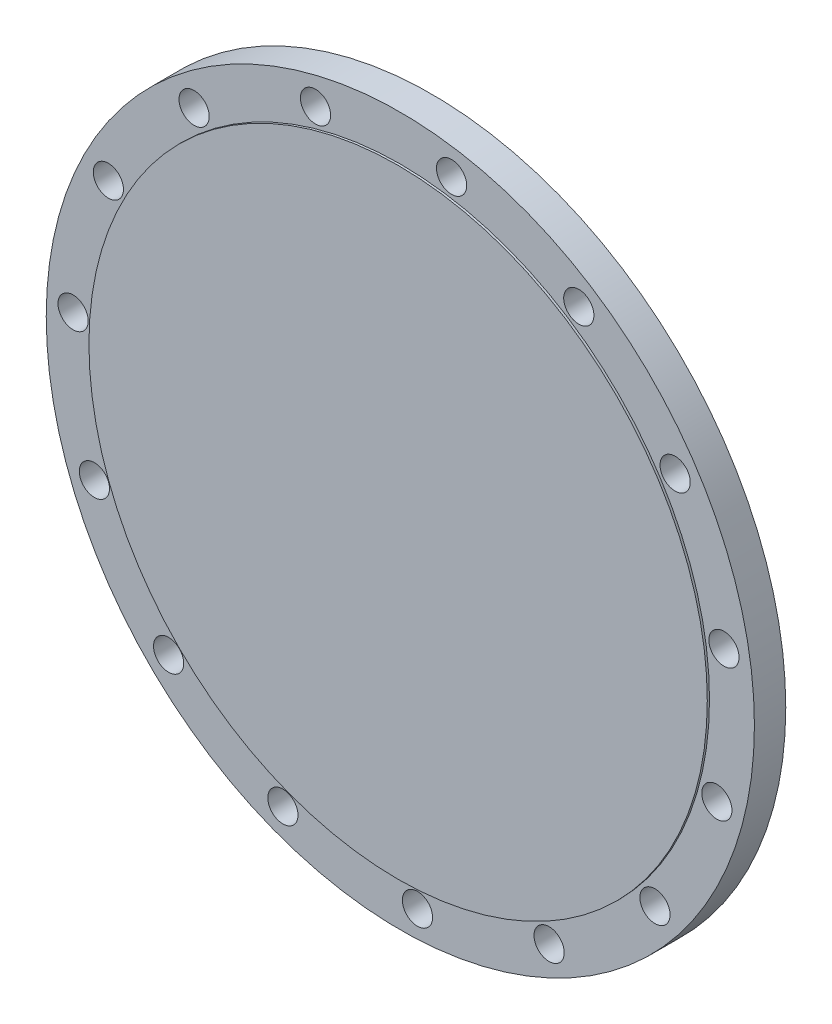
ISO-10303-21;
HEADER;
FILE_DESCRIPTION(('STEP AP214'),'2;1');
FILE_NAME('part.step','',(''),(''),'','','');
FILE_SCHEMA(('AUTOMOTIVE_DESIGN { 1 0 10303 214 1 1 1 1 }'));
ENDSEC;
DATA;
#1=APPLICATION_CONTEXT('core data for automotive mechanical design processes');
#2=APPLICATION_PROTOCOL_DEFINITION('international standard','automotive_design',2000,#1);
#3=PRODUCT_CONTEXT('',#1,'mechanical');
#4=PRODUCT('Part','Part','',(#3));
#5=PRODUCT_RELATED_PRODUCT_CATEGORY('part','',(#4));
#6=PRODUCT_DEFINITION_FORMATION('','',#4);
#7=PRODUCT_DEFINITION_CONTEXT('part definition',#1,'design');
#8=PRODUCT_DEFINITION('design','',#6,#7);
#9=PRODUCT_DEFINITION_SHAPE('','',#8);
#10=(LENGTH_UNIT() NAMED_UNIT(*) SI_UNIT(.MILLI.,.METRE.));
#11=(NAMED_UNIT(*) PLANE_ANGLE_UNIT() SI_UNIT($,.RADIAN.));
#12=(NAMED_UNIT(*) SI_UNIT($,.STERADIAN.) SOLID_ANGLE_UNIT());
#13=UNCERTAINTY_MEASURE_WITH_UNIT(LENGTH_MEASURE(1.E-05),#10,'distance_accuracy_value','');
#14=(GEOMETRIC_REPRESENTATION_CONTEXT(3) GLOBAL_UNCERTAINTY_ASSIGNED_CONTEXT((#13)) GLOBAL_UNIT_ASSIGNED_CONTEXT((#10,
#11,#12)) REPRESENTATION_CONTEXT('',''));
#15=CARTESIAN_POINT('',(0.,0.,0.));
#16=DIRECTION('',(0.,0.,1.));
#17=DIRECTION('',(1.,0.,0.));
#18=AXIS2_PLACEMENT_3D('',#15,#16,#17);
#19=CARTESIAN_POINT('',(0.,0.,31.75));
#20=DIRECTION('',(0.,0.,-1.));
#21=DIRECTION('',(-1.,0.,0.));
#22=AXIS2_PLACEMENT_3D('',#19,#20,#21);
#23=CYLINDRICAL_SURFACE('',#22,335.000000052);
#24=CARTESIAN_POINT('',(0.,0.,0.));
#25=DIRECTION('',(0.,0.,1.));
#26=DIRECTION('',(1.,0.,0.));
#27=AXIS2_PLACEMENT_3D('',#24,#25,#26);
#28=CIRCLE('',#27,335.000000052);
#29=CARTESIAN_POINT('',(335.000000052,0.,0.));
#30=VERTEX_POINT('',#29);
#31=EDGE_CURVE('E11',#30,#30,#28,.T.);
#32=ORIENTED_EDGE('',*,*,#31,.T.);
#33=EDGE_LOOP('',(#32));
#34=FACE_BOUND('',#33,.T.);
#35=CARTESIAN_POINT('',(0.,0.,29.6545));
#36=DIRECTION('',(0.,0.,1.));
#37=DIRECTION('',(1.,0.,0.));
#38=AXIS2_PLACEMENT_3D('',#35,#36,#37);
#39=CIRCLE('',#38,335.000000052);
#40=CARTESIAN_POINT('',(335.000000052,0.,29.6545));
#41=VERTEX_POINT('',#40);
#42=EDGE_CURVE('E90',#41,#41,#39,.T.);
#43=ORIENTED_EDGE('',*,*,#42,.F.);
#44=EDGE_LOOP('',(#43));
#45=FACE_BOUND('',#44,.T.);
#46=ADVANCED_FACE('F35',(#34,#45),#23,.T.);
#47=CARTESIAN_POINT('',(48.4946841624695,306.183385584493,0.));
#48=DIRECTION('',(0.,0.,1.));
#49=DIRECTION('',(1.,0.,0.));
#50=AXIS2_PLACEMENT_3D('',#47,#48,#49);
#51=CYLINDRICAL_SURFACE('',#50,14.2875);
#52=CARTESIAN_POINT('',(48.4946841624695,306.183385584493,0.));
#53=DIRECTION('',(0.,0.,1.));
#54=DIRECTION('',(1.,0.,0.));
#55=AXIS2_PLACEMENT_3D('',#52,#53,#54);
#56=CIRCLE('',#55,14.2875);
#57=CARTESIAN_POINT('',(62.7821841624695,306.183385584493,0.));
#58=VERTEX_POINT('',#57);
#59=EDGE_CURVE('E42',#58,#58,#56,.T.);
#60=ORIENTED_EDGE('',*,*,#59,.F.);
#61=EDGE_LOOP('',(#60));
#62=FACE_BOUND('',#61,.T.);
#63=CARTESIAN_POINT('',(48.4946841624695,306.183385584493,29.6545));
#64=DIRECTION('',(0.,0.,1.));
#65=DIRECTION('',(1.,0.,0.));
#66=AXIS2_PLACEMENT_3D('',#63,#64,#65);
#67=CIRCLE('',#66,14.2875);
#68=CARTESIAN_POINT('',(62.7821841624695,306.183385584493,29.6545));
#69=VERTEX_POINT('',#68);
#70=EDGE_CURVE('E93',#69,#69,#67,.F.);
#71=ORIENTED_EDGE('',*,*,#70,.F.);
#72=EDGE_LOOP('',(#71));
#73=FACE_BOUND('',#72,.T.);
#74=ADVANCED_FACE('F165',(#62,#73),#51,.F.);
#75=CARTESIAN_POINT('',(168.838100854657,259.987876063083,0.));
#76=DIRECTION('',(0.,0.,1.));
#77=DIRECTION('',(1.,0.,0.));
#78=AXIS2_PLACEMENT_3D('',#75,#76,#77);
#79=CYLINDRICAL_SURFACE('',#78,14.2875);
#80=CARTESIAN_POINT('',(168.838100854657,259.987876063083,0.));
#81=DIRECTION('',(0.,0.,1.));
#82=DIRECTION('',(0.913545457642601,-0.406736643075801,0.));
#83=AXIS2_PLACEMENT_3D('',#80,#81,#82);
#84=CIRCLE('',#83,14.2875);
#85=CARTESIAN_POINT('',(181.890381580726,254.176626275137,0.));
#86=VERTEX_POINT('',#85);
#87=EDGE_CURVE('E46',#86,#86,#84,.T.);
#88=ORIENTED_EDGE('',*,*,#87,.F.);
#89=EDGE_LOOP('',(#88));
#90=FACE_BOUND('',#89,.T.);
#91=CARTESIAN_POINT('',(168.838100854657,259.987876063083,29.6545));
#92=DIRECTION('',(0.,0.,1.));
#93=DIRECTION('',(1.,0.,0.));
#94=AXIS2_PLACEMENT_3D('',#91,#92,#93);
#95=CIRCLE('',#94,14.2875);
#96=CARTESIAN_POINT('',(183.125600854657,259.987876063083,29.6545));
#97=VERTEX_POINT('',#96);
#98=EDGE_CURVE('E96',#97,#97,#95,.F.);
#99=ORIENTED_EDGE('',*,*,#98,.F.);
#100=EDGE_LOOP('',(#99));
#101=FACE_BOUND('',#100,.T.);
#102=ADVANCED_FACE('F169',(#90,#101),#79,.F.);
#103=CARTESIAN_POINT('',(259.987876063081,168.83810085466,0.));
#104=DIRECTION('',(0.,0.,1.));
#105=DIRECTION('',(1.,0.,0.));
#106=AXIS2_PLACEMENT_3D('',#103,#104,#105);
#107=CYLINDRICAL_SURFACE('',#106,14.2875);
#108=CARTESIAN_POINT('',(259.987876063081,168.83810085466,0.));
#109=DIRECTION('',(0.,0.,1.));
#110=DIRECTION('',(0.669130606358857,-0.743144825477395,0.));
#111=AXIS2_PLACEMENT_3D('',#108,#109,#110);
#112=CIRCLE('',#111,14.2875);
#113=CARTESIAN_POINT('',(269.548079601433,158.220419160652,0.));
#114=VERTEX_POINT('',#113);
#115=EDGE_CURVE('E51',#114,#114,#112,.T.);
#116=ORIENTED_EDGE('',*,*,#115,.F.);
#117=EDGE_LOOP('',(#116));
#118=FACE_BOUND('',#117,.T.);
#119=CARTESIAN_POINT('',(259.987876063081,168.83810085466,29.6545));
#120=DIRECTION('',(0.,0.,1.));
#121=DIRECTION('',(1.,0.,0.));
#122=AXIS2_PLACEMENT_3D('',#119,#120,#121);
#123=CIRCLE('',#122,14.2875);
#124=CARTESIAN_POINT('',(274.275376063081,168.83810085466,29.6545));
#125=VERTEX_POINT('',#124);
#126=EDGE_CURVE('E99',#125,#125,#123,.F.);
#127=ORIENTED_EDGE('',*,*,#126,.F.);
#128=EDGE_LOOP('',(#127));
#129=FACE_BOUND('',#128,.T.);
#130=ADVANCED_FACE('F239',(#118,#129),#107,.F.);
#131=CARTESIAN_POINT('',(306.183385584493,48.4946841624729,0.));
#132=DIRECTION('',(0.,0.,1.));
#133=DIRECTION('',(1.,0.,0.));
#134=AXIS2_PLACEMENT_3D('',#131,#132,#133);
#135=CYLINDRICAL_SURFACE('',#134,14.2875);
#136=CARTESIAN_POINT('',(306.183385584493,48.4946841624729,0.));
#137=DIRECTION('',(0.,0.,1.));
#138=DIRECTION('',(0.309016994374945,-0.951056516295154,0.));
#139=AXIS2_PLACEMENT_3D('',#136,#137,#138);
#140=CIRCLE('',#139,14.2875);
#141=CARTESIAN_POINT('',(310.598465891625,34.9064641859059,0.));
#142=VERTEX_POINT('',#141);
#143=EDGE_CURVE('E54',#142,#142,#140,.T.);
#144=ORIENTED_EDGE('',*,*,#143,.F.);
#145=EDGE_LOOP('',(#144));
#146=FACE_BOUND('',#145,.T.);
#147=CARTESIAN_POINT('',(306.183385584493,48.4946841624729,29.6545));
#148=DIRECTION('',(0.,0.,1.));
#149=DIRECTION('',(1.,0.,0.));
#150=AXIS2_PLACEMENT_3D('',#147,#148,#149);
#151=CIRCLE('',#150,14.2875);
#152=CARTESIAN_POINT('',(320.470885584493,48.4946841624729,29.6545));
#153=VERTEX_POINT('',#152);
#154=EDGE_CURVE('E102',#153,#153,#151,.F.);
#155=ORIENTED_EDGE('',*,*,#154,.F.);
#156=EDGE_LOOP('',(#155));
#157=FACE_BOUND('',#156,.T.);
#158=ADVANCED_FACE('F235',(#146,#157),#135,.F.);
#159=CARTESIAN_POINT('',(299.437006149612,-80.2339039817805,0.));
#160=DIRECTION('',(0.,0.,1.));
#161=DIRECTION('',(1.,0.,0.));
#162=AXIS2_PLACEMENT_3D('',#159,#160,#161);
#163=CYLINDRICAL_SURFACE('',#162,14.2875);
#164=CARTESIAN_POINT('',(299.437006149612,-80.2339039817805,0.));
#165=DIRECTION('',(0.,0.,1.));
#166=DIRECTION('',(-0.104528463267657,-0.994521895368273,0.));
#167=AXIS2_PLACEMENT_3D('',#164,#165,#166);
#168=CIRCLE('',#167,14.2875);
#169=CARTESIAN_POINT('',(297.943555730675,-94.4431355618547,0.));
#170=VERTEX_POINT('',#169);
#171=EDGE_CURVE('E57',#170,#170,#168,.T.);
#172=ORIENTED_EDGE('',*,*,#171,.F.);
#173=EDGE_LOOP('',(#172));
#174=FACE_BOUND('',#173,.T.);
#175=CARTESIAN_POINT('',(299.437006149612,-80.2339039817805,29.6545));
#176=DIRECTION('',(0.,0.,1.));
#177=DIRECTION('',(1.,0.,0.));
#178=AXIS2_PLACEMENT_3D('',#175,#176,#177);
#179=CIRCLE('',#178,14.2875);
#180=CARTESIAN_POINT('',(313.724506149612,-80.2339039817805,29.6545));
#181=VERTEX_POINT('',#180);
#182=EDGE_CURVE('E105',#181,#181,#179,.F.);
#183=ORIENTED_EDGE('',*,*,#182,.F.);
#184=EDGE_LOOP('',(#183));
#185=FACE_BOUND('',#184,.T.);
#186=ADVANCED_FACE('F231',(#174,#185),#163,.F.);
#187=CARTESIAN_POINT('',(240.915248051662,-195.089321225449,0.));
#188=DIRECTION('',(0.,0.,1.));
#189=DIRECTION('',(1.,0.,0.));
#190=AXIS2_PLACEMENT_3D('',#187,#188,#189);
#191=CYLINDRICAL_SURFACE('',#190,14.2875);
#192=CARTESIAN_POINT('',(240.915248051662,-195.089321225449,0.));
#193=DIRECTION('',(0.,0.,1.));
#194=DIRECTION('',(-0.500000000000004,-0.866025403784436,0.));
#195=AXIS2_PLACEMENT_3D('',#192,#193,#194);
#196=CIRCLE('',#195,14.2875);
#197=CARTESIAN_POINT('',(233.771498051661,-207.462659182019,0.));
#198=VERTEX_POINT('',#197);
#199=EDGE_CURVE('E60',#198,#198,#196,.T.);
#200=ORIENTED_EDGE('',*,*,#199,.F.);
#201=EDGE_LOOP('',(#200));
#202=FACE_BOUND('',#201,.T.);
#203=CARTESIAN_POINT('',(240.915248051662,-195.089321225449,29.6545));
#204=DIRECTION('',(0.,0.,1.));
#205=DIRECTION('',(1.,0.,0.));
#206=AXIS2_PLACEMENT_3D('',#203,#204,#205);
#207=CIRCLE('',#206,14.2875);
#208=CARTESIAN_POINT('',(255.202748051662,-195.089321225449,29.6545));
#209=VERTEX_POINT('',#208);
#210=EDGE_CURVE('E108',#209,#209,#207,.F.);
#211=ORIENTED_EDGE('',*,*,#210,.F.);
#212=EDGE_LOOP('',(#211));
#213=FACE_BOUND('',#212,.T.);
#214=ADVANCED_FACE('F227',(#202,#213),#191,.F.);
#215=CARTESIAN_POINT('',(140.73705491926,-276.212022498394,0.));
#216=DIRECTION('',(0.,0.,1.));
#217=DIRECTION('',(1.,0.,0.));
#218=AXIS2_PLACEMENT_3D('',#215,#216,#217);
#219=CYLINDRICAL_SURFACE('',#218,14.2875);
#220=CARTESIAN_POINT('',(140.73705491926,-276.212022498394,0.));
#221=DIRECTION('',(0.,0.,1.));
#222=DIRECTION('',(-0.80901699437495,-0.587785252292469,0.));
#223=AXIS2_PLACEMENT_3D('',#220,#221,#222);
#224=CIRCLE('',#223,14.2875);
#225=CARTESIAN_POINT('',(129.178224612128,-284.610004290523,0.));
#226=VERTEX_POINT('',#225);
#227=EDGE_CURVE('E63',#226,#226,#224,.T.);
#228=ORIENTED_EDGE('',*,*,#227,.F.);
#229=EDGE_LOOP('',(#228));
#230=FACE_BOUND('',#229,.T.);
#231=CARTESIAN_POINT('',(140.73705491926,-276.212022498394,29.6545));
#232=DIRECTION('',(0.,0.,1.));
#233=DIRECTION('',(1.,0.,0.));
#234=AXIS2_PLACEMENT_3D('',#231,#232,#233);
#235=CIRCLE('',#234,14.2875);
#236=CARTESIAN_POINT('',(155.02455491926,-276.212022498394,29.6545));
#237=VERTEX_POINT('',#236);
#238=EDGE_CURVE('E111',#237,#237,#235,.F.);
#239=ORIENTED_EDGE('',*,*,#238,.F.);
#240=EDGE_LOOP('',(#239));
#241=FACE_BOUND('',#240,.T.);
#242=ADVANCED_FACE('F223',(#230,#241),#219,.F.);
#243=CARTESIAN_POINT('',(16.2241464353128,-309.575155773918,0.));
#244=DIRECTION('',(0.,0.,1.));
#245=DIRECTION('',(1.,0.,0.));
#246=AXIS2_PLACEMENT_3D('',#243,#244,#245);
#247=CYLINDRICAL_SURFACE('',#246,14.2875);
#248=CARTESIAN_POINT('',(16.2241464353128,-309.575155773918,0.));
#249=DIRECTION('',(0.,0.,1.));
#250=DIRECTION('',(-0.978147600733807,-0.207911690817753,0.));
#251=AXIS2_PLACEMENT_3D('',#248,#249,#250);
#252=CIRCLE('',#251,14.2875);
#253=CARTESIAN_POINT('',(2.24886258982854,-312.545694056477,0.));
#254=VERTEX_POINT('',#253);
#255=EDGE_CURVE('E66',#254,#254,#252,.T.);
#256=ORIENTED_EDGE('',*,*,#255,.F.);
#257=EDGE_LOOP('',(#256));
#258=FACE_BOUND('',#257,.T.);
#259=CARTESIAN_POINT('',(16.2241464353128,-309.575155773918,29.6545));
#260=DIRECTION('',(0.,0.,1.));
#261=DIRECTION('',(1.,0.,0.));
#262=AXIS2_PLACEMENT_3D('',#259,#260,#261);
#263=CIRCLE('',#262,14.2875);
#264=CARTESIAN_POINT('',(30.5116464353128,-309.575155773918,29.6545));
#265=VERTEX_POINT('',#264);
#266=EDGE_CURVE('E114',#265,#265,#263,.F.);
#267=ORIENTED_EDGE('',*,*,#266,.F.);
#268=EDGE_LOOP('',(#267));
#269=FACE_BOUND('',#268,.T.);
#270=ADVANCED_FACE('F219',(#258,#269),#247,.F.);
#271=CARTESIAN_POINT('',(-111.094064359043,-289.409932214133,0.));
#272=DIRECTION('',(0.,0.,1.));
#273=DIRECTION('',(1.,0.,0.));
#274=AXIS2_PLACEMENT_3D('',#271,#272,#273);
#275=CYLINDRICAL_SURFACE('',#274,14.2875);
#276=CARTESIAN_POINT('',(-111.094064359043,-289.409932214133,0.));
#277=DIRECTION('',(0.,0.,1.));
#278=DIRECTION('',(-0.978147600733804,0.207911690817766,0.));
#279=AXIS2_PLACEMENT_3D('',#276,#277,#278);
#280=CIRCLE('',#279,14.2875);
#281=CARTESIAN_POINT('',(-125.069348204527,-286.439393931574,0.));
#282=VERTEX_POINT('',#281);
#283=EDGE_CURVE('E69',#282,#282,#280,.T.);
#284=ORIENTED_EDGE('',*,*,#283,.F.);
#285=EDGE_LOOP('',(#284));
#286=FACE_BOUND('',#285,.T.);
#287=CARTESIAN_POINT('',(-111.094064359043,-289.409932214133,29.6545));
#288=DIRECTION('',(0.,0.,1.));
#289=DIRECTION('',(1.,0.,0.));
#290=AXIS2_PLACEMENT_3D('',#287,#288,#289);
#291=CIRCLE('',#290,14.2875);
#292=CARTESIAN_POINT('',(-96.8065643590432,-289.409932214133,29.6545));
#293=VERTEX_POINT('',#292);
#294=EDGE_CURVE('E117',#293,#293,#291,.F.);
#295=ORIENTED_EDGE('',*,*,#294,.F.);
#296=EDGE_LOOP('',(#295));
#297=FACE_BOUND('',#296,.T.);
#298=ADVANCED_FACE('F215',(#286,#297),#275,.F.);
#299=CARTESIAN_POINT('',(-219.20310216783,-219.20310216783,0.));
#300=DIRECTION('',(0.,0.,1.));
#301=DIRECTION('',(1.,0.,0.));
#302=AXIS2_PLACEMENT_3D('',#299,#300,#301);
#303=CYLINDRICAL_SURFACE('',#302,14.2875);
#304=CARTESIAN_POINT('',(-219.20310216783,-219.20310216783,0.));
#305=DIRECTION('',(0.,0.,1.));
#306=DIRECTION('',(-0.809016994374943,0.58778525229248,0.));
#307=AXIS2_PLACEMENT_3D('',#304,#305,#306);
#308=CIRCLE('',#307,14.2875);
#309=CARTESIAN_POINT('',(-230.761932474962,-210.805120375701,0.));
#310=VERTEX_POINT('',#309);
#311=EDGE_CURVE('E72',#310,#310,#308,.T.);
#312=ORIENTED_EDGE('',*,*,#311,.F.);
#313=EDGE_LOOP('',(#312));
#314=FACE_BOUND('',#313,.T.);
#315=CARTESIAN_POINT('',(-219.20310216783,-219.20310216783,29.6545));
#316=DIRECTION('',(0.,0.,1.));
#317=DIRECTION('',(1.,0.,0.));
#318=AXIS2_PLACEMENT_3D('',#315,#316,#317);
#319=CIRCLE('',#318,14.2875);
#320=CARTESIAN_POINT('',(-204.91560216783,-219.20310216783,29.6545));
#321=VERTEX_POINT('',#320);
#322=EDGE_CURVE('E120',#321,#321,#319,.F.);
#323=ORIENTED_EDGE('',*,*,#322,.F.);
#324=EDGE_LOOP('',(#323));
#325=FACE_BOUND('',#324,.T.);
#326=ADVANCED_FACE('F211',(#314,#325),#303,.F.);
#327=CARTESIAN_POINT('',(-289.409932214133,-111.094064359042,0.));
#328=DIRECTION('',(0.,0.,1.));
#329=DIRECTION('',(1.,0.,0.));
#330=AXIS2_PLACEMENT_3D('',#327,#328,#329);
#331=CYLINDRICAL_SURFACE('',#330,14.2875);
#332=CARTESIAN_POINT('',(-289.409932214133,-111.094064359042,0.));
#333=DIRECTION('',(0.,0.,1.));
#334=DIRECTION('',(-0.499999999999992,0.866025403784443,0.));
#335=AXIS2_PLACEMENT_3D('',#332,#333,#334);
#336=CIRCLE('',#335,14.2875);
#337=CARTESIAN_POINT('',(-296.553682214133,-98.7207264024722,0.));
#338=VERTEX_POINT('',#337);
#339=EDGE_CURVE('E75',#338,#338,#336,.T.);
#340=ORIENTED_EDGE('',*,*,#339,.F.);
#341=EDGE_LOOP('',(#340));
#342=FACE_BOUND('',#341,.T.);
#343=CARTESIAN_POINT('',(-289.409932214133,-111.094064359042,29.6545));
#344=DIRECTION('',(0.,0.,1.));
#345=DIRECTION('',(1.,0.,0.));
#346=AXIS2_PLACEMENT_3D('',#343,#344,#345);
#347=CIRCLE('',#346,14.2875);
#348=CARTESIAN_POINT('',(-275.122432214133,-111.094064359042,29.6545));
#349=VERTEX_POINT('',#348);
#350=EDGE_CURVE('E123',#349,#349,#347,.F.);
#351=ORIENTED_EDGE('',*,*,#350,.F.);
#352=EDGE_LOOP('',(#351));
#353=FACE_BOUND('',#352,.T.);
#354=ADVANCED_FACE('F204',(#342,#353),#331,.F.);
#355=CARTESIAN_POINT('',(-309.575155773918,16.2241464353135,0.));
#356=DIRECTION('',(0.,0.,1.));
#357=DIRECTION('',(1.,0.,0.));
#358=AXIS2_PLACEMENT_3D('',#355,#356,#357);
#359=CYLINDRICAL_SURFACE('',#358,14.2875);
#360=CARTESIAN_POINT('',(-309.575155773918,16.2241464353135,0.));
#361=DIRECTION('',(0.,0.,1.));
#362=DIRECTION('',(-0.104528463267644,0.994521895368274,0.));
#363=AXIS2_PLACEMENT_3D('',#360,#361,#362);
#364=CIRCLE('',#363,14.2875);
#365=CARTESIAN_POINT('',(-311.068606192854,30.4333780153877,0.));
#366=VERTEX_POINT('',#365);
#367=EDGE_CURVE('E78',#366,#366,#364,.T.);
#368=ORIENTED_EDGE('',*,*,#367,.F.);
#369=EDGE_LOOP('',(#368));
#370=FACE_BOUND('',#369,.T.);
#371=CARTESIAN_POINT('',(-309.575155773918,16.2241464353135,29.6545));
#372=DIRECTION('',(0.,0.,1.));
#373=DIRECTION('',(1.,0.,0.));
#374=AXIS2_PLACEMENT_3D('',#371,#372,#373);
#375=CIRCLE('',#374,14.2875);
#376=CARTESIAN_POINT('',(-295.287655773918,16.2241464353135,29.6545));
#377=VERTEX_POINT('',#376);
#378=EDGE_CURVE('E126',#377,#377,#375,.F.);
#379=ORIENTED_EDGE('',*,*,#378,.F.);
#380=EDGE_LOOP('',(#379));
#381=FACE_BOUND('',#380,.T.);
#382=ADVANCED_FACE('F198',(#370,#381),#359,.F.);
#383=CARTESIAN_POINT('',(-276.212022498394,140.737054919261,0.));
#384=DIRECTION('',(0.,0.,1.));
#385=DIRECTION('',(1.,0.,0.));
#386=AXIS2_PLACEMENT_3D('',#383,#384,#385);
#387=CYLINDRICAL_SURFACE('',#386,14.2875);
#388=CARTESIAN_POINT('',(-276.212022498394,140.737054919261,0.));
#389=DIRECTION('',(0.,0.,1.));
#390=DIRECTION('',(0.309016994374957,0.95105651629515,0.));
#391=AXIS2_PLACEMENT_3D('',#388,#389,#390);
#392=CIRCLE('',#391,14.2875);
#393=CARTESIAN_POINT('',(-271.796942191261,154.325274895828,0.));
#394=VERTEX_POINT('',#393);
#395=EDGE_CURVE('E81',#394,#394,#392,.T.);
#396=ORIENTED_EDGE('',*,*,#395,.F.);
#397=EDGE_LOOP('',(#396));
#398=FACE_BOUND('',#397,.T.);
#399=CARTESIAN_POINT('',(-276.212022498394,140.737054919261,29.6545));
#400=DIRECTION('',(0.,0.,1.));
#401=DIRECTION('',(1.,0.,0.));
#402=AXIS2_PLACEMENT_3D('',#399,#400,#401);
#403=CIRCLE('',#402,14.2875);
#404=CARTESIAN_POINT('',(-261.924522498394,140.737054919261,29.6545));
#405=VERTEX_POINT('',#404);
#406=EDGE_CURVE('E129',#405,#405,#403,.F.);
#407=ORIENTED_EDGE('',*,*,#406,.F.);
#408=EDGE_LOOP('',(#407));
#409=FACE_BOUND('',#408,.T.);
#410=ADVANCED_FACE('F159',(#398,#409),#387,.F.);
#411=CARTESIAN_POINT('',(-195.089321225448,240.915248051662,0.));
#412=DIRECTION('',(0.,0.,1.));
#413=DIRECTION('',(1.,0.,0.));
#414=AXIS2_PLACEMENT_3D('',#411,#412,#413);
#415=CYLINDRICAL_SURFACE('',#414,14.2875);
#416=CARTESIAN_POINT('',(-195.089321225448,240.915248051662,0.));
#417=DIRECTION('',(0.,0.,1.));
#418=DIRECTION('',(0.669130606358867,0.743144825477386,0.));
#419=AXIS2_PLACEMENT_3D('',#416,#417,#418);
#420=CIRCLE('',#419,14.2875);
#421=CARTESIAN_POINT('',(-185.529117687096,251.53292974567,0.));
#422=VERTEX_POINT('',#421);
#423=EDGE_CURVE('E84',#422,#422,#420,.T.);
#424=ORIENTED_EDGE('',*,*,#423,.F.);
#425=EDGE_LOOP('',(#424));
#426=FACE_BOUND('',#425,.T.);
#427=CARTESIAN_POINT('',(-195.089321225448,240.915248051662,29.6545));
#428=DIRECTION('',(0.,0.,1.));
#429=DIRECTION('',(1.,0.,0.));
#430=AXIS2_PLACEMENT_3D('',#427,#428,#429);
#431=CIRCLE('',#430,14.2875);
#432=CARTESIAN_POINT('',(-180.801821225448,240.915248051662,29.6545));
#433=VERTEX_POINT('',#432);
#434=EDGE_CURVE('E132',#433,#433,#431,.F.);
#435=ORIENTED_EDGE('',*,*,#434,.F.);
#436=EDGE_LOOP('',(#435));
#437=FACE_BOUND('',#436,.T.);
#438=ADVANCED_FACE('F151',(#426,#437),#415,.F.);
#439=CARTESIAN_POINT('',(-80.2339039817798,299.437006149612,0.));
#440=DIRECTION('',(0.,0.,1.));
#441=DIRECTION('',(1.,0.,0.));
#442=AXIS2_PLACEMENT_3D('',#439,#440,#441);
#443=CYLINDRICAL_SURFACE('',#442,14.2875);
#444=CARTESIAN_POINT('',(-80.2339039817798,299.437006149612,0.));
#445=DIRECTION('',(0.,0.,1.));
#446=DIRECTION('',(0.913545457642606,0.406736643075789,0.));
#447=AXIS2_PLACEMENT_3D('',#444,#445,#446);
#448=CIRCLE('',#447,14.2875);
#449=CARTESIAN_POINT('',(-67.1816232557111,305.248255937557,0.));
#450=VERTEX_POINT('',#449);
#451=EDGE_CURVE('E87',#450,#450,#448,.T.);
#452=ORIENTED_EDGE('',*,*,#451,.F.);
#453=EDGE_LOOP('',(#452));
#454=FACE_BOUND('',#453,.T.);
#455=CARTESIAN_POINT('',(-80.2339039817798,299.437006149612,29.6545));
#456=DIRECTION('',(0.,0.,1.));
#457=DIRECTION('',(1.,0.,0.));
#458=AXIS2_PLACEMENT_3D('',#455,#456,#457);
#459=CIRCLE('',#458,14.2875);
#460=CARTESIAN_POINT('',(-65.9464039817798,299.437006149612,29.6545));
#461=VERTEX_POINT('',#460);
#462=EDGE_CURVE('E38',#461,#461,#459,.F.);
#463=ORIENTED_EDGE('',*,*,#462,.F.);
#464=EDGE_LOOP('',(#463));
#465=FACE_BOUND('',#464,.T.);
#466=ADVANCED_FACE('F148',(#454,#465),#443,.F.);
#467=CARTESIAN_POINT('',(0.,0.,0.));
#468=DIRECTION('',(0.,0.,1.));
#469=DIRECTION('',(1.,0.,0.));
#470=AXIS2_PLACEMENT_3D('',#467,#468,#469);
#471=PLANE('',#470);
#472=ORIENTED_EDGE('',*,*,#451,.T.);
#473=EDGE_LOOP('',(#472));
#474=FACE_BOUND('',#473,.T.);
#475=ORIENTED_EDGE('',*,*,#423,.T.);
#476=EDGE_LOOP('',(#475));
#477=FACE_BOUND('',#476,.T.);
#478=ORIENTED_EDGE('',*,*,#395,.T.);
#479=EDGE_LOOP('',(#478));
#480=FACE_BOUND('',#479,.T.);
#481=ORIENTED_EDGE('',*,*,#367,.T.);
#482=EDGE_LOOP('',(#481));
#483=FACE_BOUND('',#482,.T.);
#484=ORIENTED_EDGE('',*,*,#339,.T.);
#485=EDGE_LOOP('',(#484));
#486=FACE_BOUND('',#485,.T.);
#487=ORIENTED_EDGE('',*,*,#311,.T.);
#488=EDGE_LOOP('',(#487));
#489=FACE_BOUND('',#488,.T.);
#490=ORIENTED_EDGE('',*,*,#283,.T.);
#491=EDGE_LOOP('',(#490));
#492=FACE_BOUND('',#491,.T.);
#493=ORIENTED_EDGE('',*,*,#255,.T.);
#494=EDGE_LOOP('',(#493));
#495=FACE_BOUND('',#494,.T.);
#496=ORIENTED_EDGE('',*,*,#227,.T.);
#497=EDGE_LOOP('',(#496));
#498=FACE_BOUND('',#497,.T.);
#499=ORIENTED_EDGE('',*,*,#199,.T.);
#500=EDGE_LOOP('',(#499));
#501=FACE_BOUND('',#500,.T.);
#502=ORIENTED_EDGE('',*,*,#171,.T.);
#503=EDGE_LOOP('',(#502));
#504=FACE_BOUND('',#503,.T.);
#505=ORIENTED_EDGE('',*,*,#143,.T.);
#506=EDGE_LOOP('',(#505));
#507=FACE_BOUND('',#506,.T.);
#508=ORIENTED_EDGE('',*,*,#115,.T.);
#509=EDGE_LOOP('',(#508));
#510=FACE_BOUND('',#509,.T.);
#511=ORIENTED_EDGE('',*,*,#87,.T.);
#512=EDGE_LOOP('',(#511));
#513=FACE_BOUND('',#512,.T.);
#514=ORIENTED_EDGE('',*,*,#59,.T.);
#515=EDGE_LOOP('',(#514));
#516=FACE_BOUND('',#515,.T.);
#517=ORIENTED_EDGE('',*,*,#31,.F.);
#518=EDGE_LOOP('',(#517));
#519=FACE_BOUND('',#518,.T.);
#520=ADVANCED_FACE('F150',(#474,#477,#480,#483,#486,#489,#492,#495,#498,#501,#504,#507,#510,
#513,#516,#519),#471,.F.);
#521=CARTESIAN_POINT('',(0.,0.,29.6545));
#522=DIRECTION('',(0.,0.,1.));
#523=DIRECTION('',(1.,0.,0.));
#524=AXIS2_PLACEMENT_3D('',#521,#522,#523);
#525=PLANE('',#524);
#526=ORIENTED_EDGE('',*,*,#70,.T.);
#527=EDGE_LOOP('',(#526));
#528=FACE_BOUND('',#527,.T.);
#529=ORIENTED_EDGE('',*,*,#126,.T.);
#530=EDGE_LOOP('',(#529));
#531=FACE_BOUND('',#530,.T.);
#532=ORIENTED_EDGE('',*,*,#182,.T.);
#533=EDGE_LOOP('',(#532));
#534=FACE_BOUND('',#533,.T.);
#535=ORIENTED_EDGE('',*,*,#238,.T.);
#536=EDGE_LOOP('',(#535));
#537=FACE_BOUND('',#536,.T.);
#538=ORIENTED_EDGE('',*,*,#294,.T.);
#539=EDGE_LOOP('',(#538));
#540=FACE_BOUND('',#539,.T.);
#541=ORIENTED_EDGE('',*,*,#350,.T.);
#542=EDGE_LOOP('',(#541));
#543=FACE_BOUND('',#542,.T.);
#544=ORIENTED_EDGE('',*,*,#406,.T.);
#545=EDGE_LOOP('',(#544));
#546=FACE_BOUND('',#545,.T.);
#547=ORIENTED_EDGE('',*,*,#462,.T.);
#548=EDGE_LOOP('',(#547));
#549=FACE_BOUND('',#548,.T.);
#550=CARTESIAN_POINT('',(0.,0.,29.6545));
#551=DIRECTION('',(0.,0.,1.));
#552=DIRECTION('',(1.,0.,0.));
#553=AXIS2_PLACEMENT_3D('',#550,#551,#552);
#554=CIRCLE('',#553,292.5);
#555=CARTESIAN_POINT('',(292.5,0.,29.6545));
#556=VERTEX_POINT('',#555);
#557=EDGE_CURVE('E138',#556,#556,#554,.T.);
#558=ORIENTED_EDGE('',*,*,#557,.F.);
#559=EDGE_LOOP('',(#558));
#560=FACE_BOUND('',#559,.T.);
#561=ORIENTED_EDGE('',*,*,#434,.T.);
#562=EDGE_LOOP('',(#561));
#563=FACE_BOUND('',#562,.T.);
#564=ORIENTED_EDGE('',*,*,#378,.T.);
#565=EDGE_LOOP('',(#564));
#566=FACE_BOUND('',#565,.T.);
#567=ORIENTED_EDGE('',*,*,#322,.T.);
#568=EDGE_LOOP('',(#567));
#569=FACE_BOUND('',#568,.T.);
#570=ORIENTED_EDGE('',*,*,#266,.T.);
#571=EDGE_LOOP('',(#570));
#572=FACE_BOUND('',#571,.T.);
#573=ORIENTED_EDGE('',*,*,#210,.T.);
#574=EDGE_LOOP('',(#573));
#575=FACE_BOUND('',#574,.T.);
#576=ORIENTED_EDGE('',*,*,#154,.T.);
#577=EDGE_LOOP('',(#576));
#578=FACE_BOUND('',#577,.T.);
#579=ORIENTED_EDGE('',*,*,#98,.T.);
#580=EDGE_LOOP('',(#579));
#581=FACE_BOUND('',#580,.T.);
#582=ORIENTED_EDGE('',*,*,#42,.T.);
#583=EDGE_LOOP('',(#582));
#584=FACE_BOUND('',#583,.T.);
#585=ADVANCED_FACE('F145',(#528,#531,#534,#537,#540,#543,#546,#549,#560,#563,#566,#569,#572,
#575,#578,#581,#584),#525,.T.);
#586=CARTESIAN_POINT('',(0.,0.,29.6545));
#587=DIRECTION('',(0.,0.,1.));
#588=DIRECTION('',(1.,0.,0.));
#589=AXIS2_PLACEMENT_3D('',#586,#587,#588);
#590=CYLINDRICAL_SURFACE('',#589,292.5);
#591=ORIENTED_EDGE('',*,*,#557,.T.);
#592=EDGE_LOOP('',(#591));
#593=FACE_BOUND('',#592,.T.);
#594=CARTESIAN_POINT('',(0.,0.,31.75));
#595=DIRECTION('',(0.,0.,1.));
#596=DIRECTION('',(1.,0.,0.));
#597=AXIS2_PLACEMENT_3D('',#594,#595,#596);
#598=CIRCLE('',#597,292.5);
#599=CARTESIAN_POINT('',(292.5,0.,31.75));
#600=VERTEX_POINT('',#599);
#601=EDGE_CURVE('E135',#600,#600,#598,.T.);
#602=ORIENTED_EDGE('',*,*,#601,.F.);
#603=EDGE_LOOP('',(#602));
#604=FACE_BOUND('',#603,.T.);
#605=ADVANCED_FACE('F176',(#593,#604),#590,.T.);
#606=CARTESIAN_POINT('',(0.,0.,31.75));
#607=DIRECTION('',(0.,0.,1.));
#608=DIRECTION('',(1.,0.,0.));
#609=AXIS2_PLACEMENT_3D('',#606,#607,#608);
#610=PLANE('',#609);
#611=ORIENTED_EDGE('',*,*,#601,.T.);
#612=EDGE_LOOP('',(#611));
#613=FACE_BOUND('',#612,.T.);
#614=ADVANCED_FACE('F181',(#613),#610,.T.);
#615=CLOSED_SHELL('',(#46,#74,#102,#130,#158,#186,#214,#242,#270,#298,#326,#354,#382,#410,#438,
#466,#520,#585,#605,#614));
#616=MANIFOLD_SOLID_BREP('B2',#615);
#617=ADVANCED_BREP_SHAPE_REPRESENTATION('',(#18,#616),#14);
#618=SHAPE_DEFINITION_REPRESENTATION(#9,#617);
ENDSEC;
END-ISO-10303-21;
